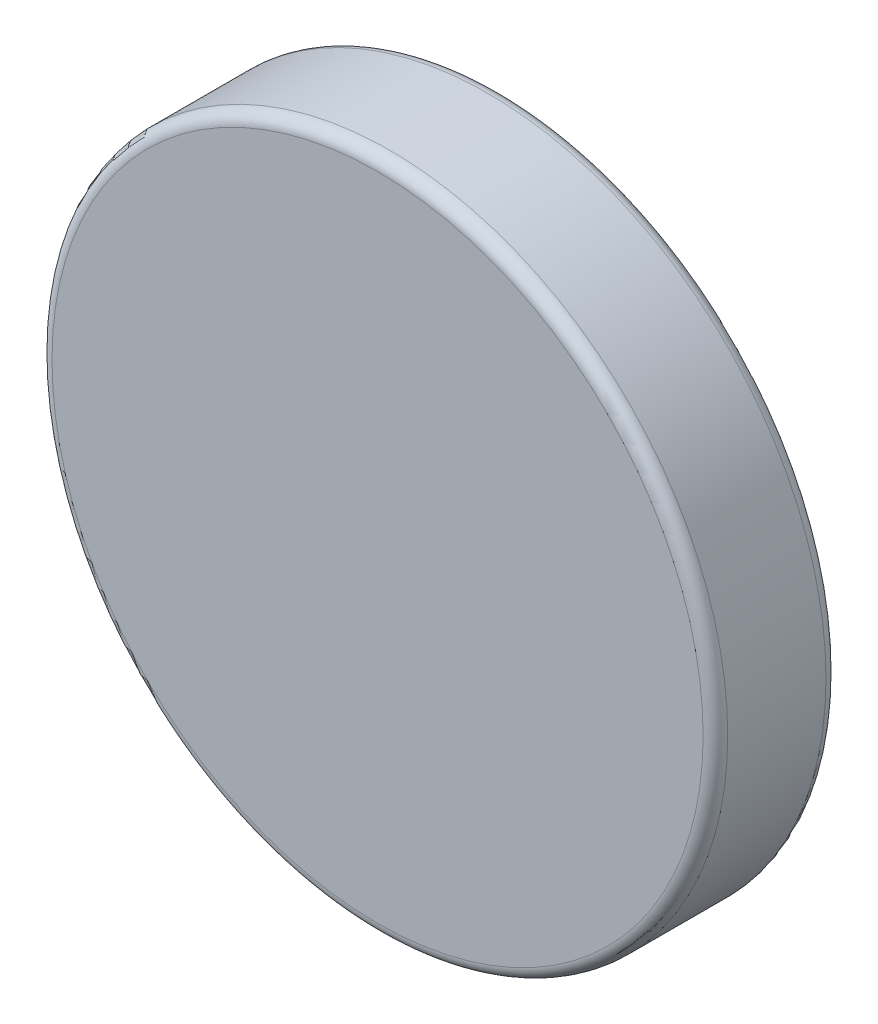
from build123d import *

# Parameters (mm, degrees)
SKIZZE1_R                       = 2.75
AUFSATZ_LINEAR_AUSTRAGEN1_DEPTH = 1
SKIZZE2_R                       = 2.25
SCHNITT_LINEAR_AUSTRAGEN1_DEPTH = 0.8
VERRUNDUNG1_R                   = 0.1


with BuildPart() as part:
    # Skizze1 → Aufsatz-Linear austragen1 (new body)
    with BuildSketch(Plane.XY):
        Circle(SKIZZE1_R)
    extrude(amount=AUFSATZ_LINEAR_AUSTRAGEN1_DEPTH)

    # Skizze2 → Schnitt-Linear austragen1 (cut)
    with BuildSketch(Plane(origin=(0, 0, 0), x_dir=(-1, 0, 0), z_dir=(0, 0, -1))):
        Circle(SKIZZE2_R)
    extrude(amount=-SCHNITT_LINEAR_AUSTRAGEN1_DEPTH, mode=Mode.SUBTRACT)

    # Verrundung1
    verrundung1_edges = [part.edges().sort_by_distance(p)[0] for p in [
        (-2.75, 0, 0),
        (-2.75, 0, 1),
        (2.25, 0, 0),
    ]]
    fillet(verrundung1_edges, radius=VERRUNDUNG1_R)


solid = part.part
